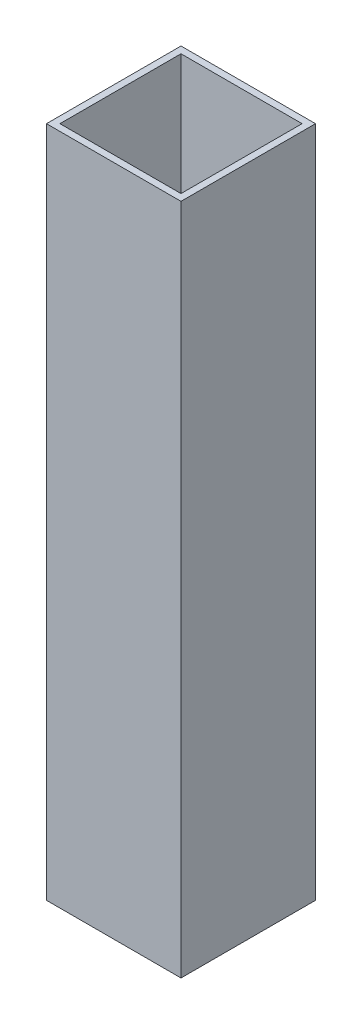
ISO-10303-21;
HEADER;
FILE_DESCRIPTION(('STEP AP214'),'2;1');
FILE_NAME('part.step','',(''),(''),'','','');
FILE_SCHEMA(('AUTOMOTIVE_DESIGN { 1 0 10303 214 1 1 1 1 }'));
ENDSEC;
DATA;
#1=APPLICATION_CONTEXT('core data for automotive mechanical design processes');
#2=APPLICATION_PROTOCOL_DEFINITION('international standard','automotive_design',2000,#1);
#3=PRODUCT_CONTEXT('',#1,'mechanical');
#4=PRODUCT('Part','Part','',(#3));
#5=PRODUCT_RELATED_PRODUCT_CATEGORY('part','',(#4));
#6=PRODUCT_DEFINITION_FORMATION('','',#4);
#7=PRODUCT_DEFINITION_CONTEXT('part definition',#1,'design');
#8=PRODUCT_DEFINITION('design','',#6,#7);
#9=PRODUCT_DEFINITION_SHAPE('','',#8);
#10=(LENGTH_UNIT() NAMED_UNIT(*) SI_UNIT(.MILLI.,.METRE.));
#11=(NAMED_UNIT(*) PLANE_ANGLE_UNIT() SI_UNIT($,.RADIAN.));
#12=(NAMED_UNIT(*) SI_UNIT($,.STERADIAN.) SOLID_ANGLE_UNIT());
#13=UNCERTAINTY_MEASURE_WITH_UNIT(LENGTH_MEASURE(1.E-05),#10,'distance_accuracy_value','');
#14=(GEOMETRIC_REPRESENTATION_CONTEXT(3) GLOBAL_UNCERTAINTY_ASSIGNED_CONTEXT((#13)) GLOBAL_UNIT_ASSIGNED_CONTEXT((#10,
#11,#12)) REPRESENTATION_CONTEXT('',''));
#15=CARTESIAN_POINT('',(0.,0.,0.));
#16=DIRECTION('',(0.,0.,1.));
#17=DIRECTION('',(1.,0.,0.));
#18=AXIS2_PLACEMENT_3D('',#15,#16,#17);
#19=CARTESIAN_POINT('',(100.,1000.,-100.));
#20=DIRECTION('',(-1.,0.,0.));
#21=DIRECTION('',(0.,0.,1.));
#22=AXIS2_PLACEMENT_3D('',#19,#20,#21);
#23=PLANE('',#22);
#24=DIRECTION('',(0.,0.,-1.));
#25=VECTOR('',#24,1.);
#26=CARTESIAN_POINT('',(100.,0.,-100.));
#27=LINE('',#26,#25);
#28=CARTESIAN_POINT('',(100.,0.,100.));
#29=VERTEX_POINT('',#28);
#30=CARTESIAN_POINT('',(100.,0.,-100.));
#31=VERTEX_POINT('',#30);
#32=EDGE_CURVE('E140',#29,#31,#27,.T.);
#33=ORIENTED_EDGE('',*,*,#32,.T.);
#34=DIRECTION('',(0.,-1.,0.));
#35=VECTOR('',#34,1.);
#36=CARTESIAN_POINT('',(100.,1000.,-100.));
#37=LINE('',#36,#35);
#38=CARTESIAN_POINT('',(100.,1000.,-100.));
#39=VERTEX_POINT('',#38);
#40=EDGE_CURVE('E11',#39,#31,#37,.T.);
#41=ORIENTED_EDGE('',*,*,#40,.F.);
#42=DIRECTION('',(0.,0.,-1.));
#43=VECTOR('',#42,1.);
#44=CARTESIAN_POINT('',(100.,1000.,-100.));
#45=LINE('',#44,#43);
#46=CARTESIAN_POINT('',(100.,1000.,100.));
#47=VERTEX_POINT('',#46);
#48=EDGE_CURVE('E129',#47,#39,#45,.T.);
#49=ORIENTED_EDGE('',*,*,#48,.F.);
#50=DIRECTION('',(0.,-1.,0.));
#51=VECTOR('',#50,1.);
#52=CARTESIAN_POINT('',(100.,1000.,100.));
#53=LINE('',#52,#51);
#54=EDGE_CURVE('E139',#47,#29,#53,.T.);
#55=ORIENTED_EDGE('',*,*,#54,.T.);
#56=EDGE_LOOP('',(#33,#41,#49,#55));
#57=FACE_BOUND('',#56,.T.);
#58=ADVANCED_FACE('F32',(#57),#23,.F.);
#59=CARTESIAN_POINT('',(-100.,1000.,-100.));
#60=DIRECTION('',(0.,0.,1.));
#61=DIRECTION('',(1.,0.,0.));
#62=AXIS2_PLACEMENT_3D('',#59,#60,#61);
#63=PLANE('',#62);
#64=DIRECTION('',(-1.,0.,0.));
#65=VECTOR('',#64,1.);
#66=CARTESIAN_POINT('',(-100.,0.,-100.));
#67=LINE('',#66,#65);
#68=CARTESIAN_POINT('',(-100.,0.,-100.));
#69=VERTEX_POINT('',#68);
#70=EDGE_CURVE('E143',#31,#69,#67,.T.);
#71=ORIENTED_EDGE('',*,*,#70,.T.);
#72=DIRECTION('',(0.,-1.,0.));
#73=VECTOR('',#72,1.);
#74=CARTESIAN_POINT('',(-100.,1000.,-100.));
#75=LINE('',#74,#73);
#76=CARTESIAN_POINT('',(-100.,1000.,-100.));
#77=VERTEX_POINT('',#76);
#78=EDGE_CURVE('E39',#77,#69,#75,.T.);
#79=ORIENTED_EDGE('',*,*,#78,.F.);
#80=DIRECTION('',(-1.,0.,0.));
#81=VECTOR('',#80,1.);
#82=CARTESIAN_POINT('',(-100.,1000.,-100.));
#83=LINE('',#82,#81);
#84=EDGE_CURVE('E132',#39,#77,#83,.T.);
#85=ORIENTED_EDGE('',*,*,#84,.F.);
#86=ORIENTED_EDGE('',*,*,#40,.T.);
#87=EDGE_LOOP('',(#71,#79,#85,#86));
#88=FACE_BOUND('',#87,.T.);
#89=ADVANCED_FACE('F171',(#88),#63,.F.);
#90=CARTESIAN_POINT('',(-100.,1000.,-100.));
#91=DIRECTION('',(1.,0.,0.));
#92=DIRECTION('',(0.,0.,-1.));
#93=AXIS2_PLACEMENT_3D('',#90,#91,#92);
#94=PLANE('',#93);
#95=DIRECTION('',(0.,0.,1.));
#96=VECTOR('',#95,1.);
#97=CARTESIAN_POINT('',(-100.,0.,-100.));
#98=LINE('',#97,#96);
#99=CARTESIAN_POINT('',(-100.,0.,100.));
#100=VERTEX_POINT('',#99);
#101=EDGE_CURVE('E145',#69,#100,#98,.T.);
#102=ORIENTED_EDGE('',*,*,#101,.T.);
#103=DIRECTION('',(0.,-1.,0.));
#104=VECTOR('',#103,1.);
#105=CARTESIAN_POINT('',(-100.,1000.,100.));
#106=LINE('',#105,#104);
#107=CARTESIAN_POINT('',(-100.,1000.,100.));
#108=VERTEX_POINT('',#107);
#109=EDGE_CURVE('E150',#108,#100,#106,.T.);
#110=ORIENTED_EDGE('',*,*,#109,.F.);
#111=DIRECTION('',(0.,0.,1.));
#112=VECTOR('',#111,1.);
#113=CARTESIAN_POINT('',(-100.,1000.,-100.));
#114=LINE('',#113,#112);
#115=EDGE_CURVE('E135',#77,#108,#114,.T.);
#116=ORIENTED_EDGE('',*,*,#115,.F.);
#117=ORIENTED_EDGE('',*,*,#78,.T.);
#118=EDGE_LOOP('',(#102,#110,#116,#117));
#119=FACE_BOUND('',#118,.T.);
#120=ADVANCED_FACE('F157',(#119),#94,.F.);
#121=CARTESIAN_POINT('',(-100.,1000.,100.));
#122=DIRECTION('',(0.,0.,-1.));
#123=DIRECTION('',(-1.,0.,0.));
#124=AXIS2_PLACEMENT_3D('',#121,#122,#123);
#125=PLANE('',#124);
#126=DIRECTION('',(1.,0.,0.));
#127=VECTOR('',#126,1.);
#128=CARTESIAN_POINT('',(-100.,0.,100.));
#129=LINE('',#128,#127);
#130=EDGE_CURVE('E133',#100,#29,#129,.T.);
#131=ORIENTED_EDGE('',*,*,#130,.T.);
#132=ORIENTED_EDGE('',*,*,#54,.F.);
#133=DIRECTION('',(1.,0.,0.));
#134=VECTOR('',#133,1.);
#135=CARTESIAN_POINT('',(-100.,1000.,100.));
#136=LINE('',#135,#134);
#137=EDGE_CURVE('E137',#108,#47,#136,.T.);
#138=ORIENTED_EDGE('',*,*,#137,.F.);
#139=ORIENTED_EDGE('',*,*,#109,.T.);
#140=EDGE_LOOP('',(#131,#132,#138,#139));
#141=FACE_BOUND('',#140,.T.);
#142=ADVANCED_FACE('F164',(#141),#125,.F.);
#143=CARTESIAN_POINT('',(0.,1000.,0.));
#144=DIRECTION('',(0.,1.,0.));
#145=DIRECTION('',(0.,0.,1.));
#146=AXIS2_PLACEMENT_3D('',#143,#144,#145);
#147=PLANE('',#146);
#148=DIRECTION('',(0.,0.,-1.));
#149=VECTOR('',#148,1.);
#150=CARTESIAN_POINT('',(90.,1000.,-100.));
#151=LINE('',#150,#149);
#152=CARTESIAN_POINT('',(90.,1000.,90.));
#153=VERTEX_POINT('',#152);
#154=CARTESIAN_POINT('',(90.,1000.,-90.));
#155=VERTEX_POINT('',#154);
#156=EDGE_CURVE('E117',#153,#155,#151,.T.);
#157=ORIENTED_EDGE('',*,*,#156,.F.);
#158=DIRECTION('',(1.,0.,0.));
#159=VECTOR('',#158,1.);
#160=CARTESIAN_POINT('',(-100.,1000.,90.));
#161=LINE('',#160,#159);
#162=CARTESIAN_POINT('',(-90.,1000.,90.));
#163=VERTEX_POINT('',#162);
#164=EDGE_CURVE('E101',#163,#153,#161,.T.);
#165=ORIENTED_EDGE('',*,*,#164,.F.);
#166=DIRECTION('',(0.,0.,1.));
#167=VECTOR('',#166,1.);
#168=CARTESIAN_POINT('',(-90.,1000.,-100.));
#169=LINE('',#168,#167);
#170=CARTESIAN_POINT('',(-90.,1000.,-90.));
#171=VERTEX_POINT('',#170);
#172=EDGE_CURVE('E126',#171,#163,#169,.T.);
#173=ORIENTED_EDGE('',*,*,#172,.F.);
#174=DIRECTION('',(-1.,0.,0.));
#175=VECTOR('',#174,1.);
#176=CARTESIAN_POINT('',(-100.,1000.,-90.));
#177=LINE('',#176,#175);
#178=EDGE_CURVE('E119',#155,#171,#177,.T.);
#179=ORIENTED_EDGE('',*,*,#178,.F.);
#180=EDGE_LOOP('',(#157,#165,#173,#179));
#181=FACE_BOUND('',#180,.T.);
#182=ORIENTED_EDGE('',*,*,#48,.T.);
#183=ORIENTED_EDGE('',*,*,#84,.T.);
#184=ORIENTED_EDGE('',*,*,#115,.T.);
#185=ORIENTED_EDGE('',*,*,#137,.T.);
#186=EDGE_LOOP('',(#182,#183,#184,#185));
#187=FACE_BOUND('',#186,.T.);
#188=ADVANCED_FACE('F170',(#181,#187),#147,.T.);
#189=CARTESIAN_POINT('',(0.,0.,0.));
#190=DIRECTION('',(0.,1.,0.));
#191=DIRECTION('',(0.,0.,1.));
#192=AXIS2_PLACEMENT_3D('',#189,#190,#191);
#193=PLANE('',#192);
#194=DIRECTION('',(1.,0.,0.));
#195=VECTOR('',#194,1.);
#196=CARTESIAN_POINT('',(-100.,0.,90.));
#197=LINE('',#196,#195);
#198=CARTESIAN_POINT('',(-90.,0.,90.));
#199=VERTEX_POINT('',#198);
#200=CARTESIAN_POINT('',(90.,0.,90.));
#201=VERTEX_POINT('',#200);
#202=EDGE_CURVE('E99',#199,#201,#197,.T.);
#203=ORIENTED_EDGE('',*,*,#202,.T.);
#204=DIRECTION('',(0.,0.,-1.));
#205=VECTOR('',#204,1.);
#206=CARTESIAN_POINT('',(90.,0.,-100.));
#207=LINE('',#206,#205);
#208=CARTESIAN_POINT('',(90.,0.,-90.));
#209=VERTEX_POINT('',#208);
#210=EDGE_CURVE('E107',#201,#209,#207,.T.);
#211=ORIENTED_EDGE('',*,*,#210,.T.);
#212=DIRECTION('',(-1.,0.,0.));
#213=VECTOR('',#212,1.);
#214=CARTESIAN_POINT('',(-100.,0.,-90.));
#215=LINE('',#214,#213);
#216=CARTESIAN_POINT('',(-90.,0.,-90.));
#217=VERTEX_POINT('',#216);
#218=EDGE_CURVE('E113',#209,#217,#215,.T.);
#219=ORIENTED_EDGE('',*,*,#218,.T.);
#220=DIRECTION('',(0.,0.,1.));
#221=VECTOR('',#220,1.);
#222=CARTESIAN_POINT('',(-90.,0.,-100.));
#223=LINE('',#222,#221);
#224=EDGE_CURVE('E53',#217,#199,#223,.T.);
#225=ORIENTED_EDGE('',*,*,#224,.T.);
#226=EDGE_LOOP('',(#203,#211,#219,#225));
#227=FACE_BOUND('',#226,.T.);
#228=ORIENTED_EDGE('',*,*,#32,.F.);
#229=ORIENTED_EDGE('',*,*,#130,.F.);
#230=ORIENTED_EDGE('',*,*,#101,.F.);
#231=ORIENTED_EDGE('',*,*,#70,.F.);
#232=EDGE_LOOP('',(#228,#229,#230,#231));
#233=FACE_BOUND('',#232,.T.);
#234=ADVANCED_FACE('F115',(#227,#233),#193,.F.);
#235=CARTESIAN_POINT('',(90.,1000.,-100.));
#236=DIRECTION('',(-1.,0.,0.));
#237=DIRECTION('',(0.,0.,1.));
#238=AXIS2_PLACEMENT_3D('',#235,#236,#237);
#239=PLANE('',#238);
#240=ORIENTED_EDGE('',*,*,#210,.F.);
#241=DIRECTION('',(0.,-1.,0.));
#242=VECTOR('',#241,1.);
#243=CARTESIAN_POINT('',(90.,1000.,90.));
#244=LINE('',#243,#242);
#245=EDGE_CURVE('E95',#153,#201,#244,.T.);
#246=ORIENTED_EDGE('',*,*,#245,.F.);
#247=ORIENTED_EDGE('',*,*,#156,.T.);
#248=DIRECTION('',(0.,-1.,0.));
#249=VECTOR('',#248,1.);
#250=CARTESIAN_POINT('',(90.,1000.,-90.));
#251=LINE('',#250,#249);
#252=EDGE_CURVE('E110',#155,#209,#251,.T.);
#253=ORIENTED_EDGE('',*,*,#252,.T.);
#254=EDGE_LOOP('',(#240,#246,#247,#253));
#255=FACE_BOUND('',#254,.T.);
#256=ADVANCED_FACE('F108',(#255),#239,.T.);
#257=CARTESIAN_POINT('',(-100.,1000.,-90.));
#258=DIRECTION('',(0.,0.,1.));
#259=DIRECTION('',(1.,0.,0.));
#260=AXIS2_PLACEMENT_3D('',#257,#258,#259);
#261=PLANE('',#260);
#262=ORIENTED_EDGE('',*,*,#218,.F.);
#263=ORIENTED_EDGE('',*,*,#252,.F.);
#264=ORIENTED_EDGE('',*,*,#178,.T.);
#265=DIRECTION('',(0.,-1.,0.));
#266=VECTOR('',#265,1.);
#267=CARTESIAN_POINT('',(-90.,1000.,-90.));
#268=LINE('',#267,#266);
#269=EDGE_CURVE('E255',#171,#217,#268,.T.);
#270=ORIENTED_EDGE('',*,*,#269,.T.);
#271=EDGE_LOOP('',(#262,#263,#264,#270));
#272=FACE_BOUND('',#271,.T.);
#273=ADVANCED_FACE('F191',(#272),#261,.T.);
#274=CARTESIAN_POINT('',(-90.,1000.,-100.));
#275=DIRECTION('',(1.,0.,0.));
#276=DIRECTION('',(0.,0.,-1.));
#277=AXIS2_PLACEMENT_3D('',#274,#275,#276);
#278=PLANE('',#277);
#279=ORIENTED_EDGE('',*,*,#224,.F.);
#280=ORIENTED_EDGE('',*,*,#269,.F.);
#281=ORIENTED_EDGE('',*,*,#172,.T.);
#282=DIRECTION('',(0.,-1.,0.));
#283=VECTOR('',#282,1.);
#284=CARTESIAN_POINT('',(-90.,1000.,90.));
#285=LINE('',#284,#283);
#286=EDGE_CURVE('E46',#163,#199,#285,.T.);
#287=ORIENTED_EDGE('',*,*,#286,.T.);
#288=EDGE_LOOP('',(#279,#280,#281,#287));
#289=FACE_BOUND('',#288,.T.);
#290=ADVANCED_FACE('F188',(#289),#278,.T.);
#291=CARTESIAN_POINT('',(-100.,1000.,90.));
#292=DIRECTION('',(0.,0.,-1.));
#293=DIRECTION('',(-1.,0.,0.));
#294=AXIS2_PLACEMENT_3D('',#291,#292,#293);
#295=PLANE('',#294);
#296=ORIENTED_EDGE('',*,*,#202,.F.);
#297=ORIENTED_EDGE('',*,*,#286,.F.);
#298=ORIENTED_EDGE('',*,*,#164,.T.);
#299=ORIENTED_EDGE('',*,*,#245,.T.);
#300=EDGE_LOOP('',(#296,#297,#298,#299));
#301=FACE_BOUND('',#300,.T.);
#302=ADVANCED_FACE('F97',(#301),#295,.T.);
#303=CLOSED_SHELL('',(#58,#89,#120,#142,#188,#234,#256,#273,#290,#302));
#304=MANIFOLD_SOLID_BREP('B2',#303);
#305=ADVANCED_BREP_SHAPE_REPRESENTATION('',(#18,#304),#14);
#306=SHAPE_DEFINITION_REPRESENTATION(#9,#305);
ENDSEC;
END-ISO-10303-21;
